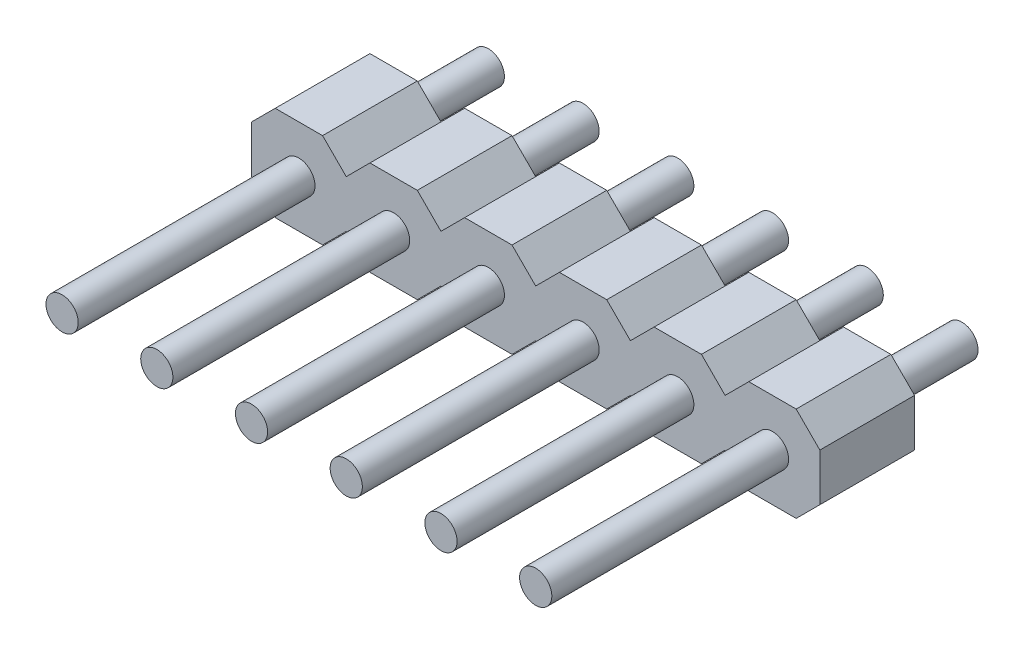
from build123d import *

# Parameters (mm, degrees)
BOSS_EXTRUDE1_DEPTH        = 2.54
BOSS_EXTRUDE4_DEPTH        = 2.54
BOSS_EXTRUDE4_DEPTH_BACK   = 8.89
SKETCH6_R                  = 0.4318
BOSS_EXTRUDE4_2_DEPTH      = 2.54
BOSS_EXTRUDE4_2_DEPTH_BACK = 8.89
BOSS_EXTRUDE4_3_DEPTH      = 2.54
BOSS_EXTRUDE4_3_DEPTH_BACK = 8.89
BOSS_EXTRUDE4_4_DEPTH      = 2.54
BOSS_EXTRUDE4_4_DEPTH_BACK = 8.89
BOSS_EXTRUDE4_5_DEPTH      = 2.54
BOSS_EXTRUDE4_5_DEPTH_BACK = 8.89
BOSS_EXTRUDE4_6_DEPTH      = 2.54
BOSS_EXTRUDE4_6_DEPTH_BACK = 8.89


with BuildPart() as part:
    # Sketch1 → Boss-Extrude1 (new body)
    with BuildSketch(Plane.XY):
        Polygon((13.97, -0.635), (13.335, -1.27), (12.065, -1.27), (11.43, -0.635), (10.795, -1.27), (9.525, -1.27), (8.89, -0.635), (8.255, -1.27), (6.985, -1.27), (6.35, -0.635), (5.715, -1.27), (4.445, -1.27), (3.81, -0.635), (3.175, -1.27), (1.905, -1.27), (1.27, -0.635), (0.635, -1.27), (-0.635, -1.27), (-1.27, -0.635), (-1.27, 0.635), (-0.635, 1.27), (0.635, 1.27), (1.27, 0.635), (1.905, 1.27), (3.175, 1.27), (3.81, 0.635), (4.445, 1.27), (5.715, 1.27), (6.35, 0.635), (6.985, 1.27), (8.255, 1.27), (8.89, 0.635), (9.525, 1.27), (10.795, 1.27), (11.43, 0.635), (12.065, 1.27), (13.335, 1.27), (13.97, 0.635), align=None)
    extrude(amount=BOSS_EXTRUDE1_DEPTH)


with BuildPart() as body_2:
    # Sketch6 → Boss-Extrude4 (new, two sides: drawn at the far end of the back side and taken through both)
    with BuildSketch(Plane(origin=(0, 0, 0), x_dir=(-1, 0, 0), z_dir=(0, 0, -1)).offset(-BOSS_EXTRUDE4_DEPTH_BACK)):
        Circle(SKETCH6_R)
    extrude(amount=BOSS_EXTRUDE4_DEPTH + BOSS_EXTRUDE4_DEPTH_BACK)


with BuildPart() as body_3:
    # Sketch6 → Boss-Extrude4 2 (new, two sides: drawn at the far end of the back side and taken through both)
    with BuildSketch(Plane(origin=(0, 0, 0), x_dir=(-1, 0, 0), z_dir=(0, 0, -1)).offset(-BOSS_EXTRUDE4_2_DEPTH_BACK)):
        with Locations((-2.54, 0)):
            Circle(SKETCH6_R)
    extrude(amount=BOSS_EXTRUDE4_2_DEPTH + BOSS_EXTRUDE4_2_DEPTH_BACK)


with BuildPart() as body_4:
    # Sketch6 → Boss-Extrude4 3 (new, two sides: drawn at the far end of the back side and taken through both)
    with BuildSketch(Plane(origin=(0, 0, 0), x_dir=(-1, 0, 0), z_dir=(0, 0, -1)).offset(-BOSS_EXTRUDE4_3_DEPTH_BACK)):
        with Locations((-5.08, 0)):
            Circle(SKETCH6_R)
    extrude(amount=BOSS_EXTRUDE4_3_DEPTH + BOSS_EXTRUDE4_3_DEPTH_BACK)


with BuildPart() as body_5:
    # Sketch6 → Boss-Extrude4 4 (new, two sides: drawn at the far end of the back side and taken through both)
    with BuildSketch(Plane(origin=(0, 0, 0), x_dir=(-1, 0, 0), z_dir=(0, 0, -1)).offset(-BOSS_EXTRUDE4_4_DEPTH_BACK)):
        with Locations((-7.62, 0)):
            Circle(SKETCH6_R)
    extrude(amount=BOSS_EXTRUDE4_4_DEPTH + BOSS_EXTRUDE4_4_DEPTH_BACK)


with BuildPart() as body_6:
    # Sketch6 → Boss-Extrude4 5 (new, two sides: drawn at the far end of the back side and taken through both)
    with BuildSketch(Plane(origin=(0, 0, 0), x_dir=(-1, 0, 0), z_dir=(0, 0, -1)).offset(-BOSS_EXTRUDE4_5_DEPTH_BACK)):
        with Locations((-10.16, 0)):
            Circle(SKETCH6_R)
    extrude(amount=BOSS_EXTRUDE4_5_DEPTH + BOSS_EXTRUDE4_5_DEPTH_BACK)


with BuildPart() as body_7:
    # Sketch6 → Boss-Extrude4 6 (new, two sides: drawn at the far end of the back side and taken through both)
    with BuildSketch(Plane(origin=(0, 0, 0), x_dir=(-1, 0, 0), z_dir=(0, 0, -1)).offset(-BOSS_EXTRUDE4_6_DEPTH_BACK)):
        with Locations((-12.7, 0)):
            Circle(SKETCH6_R)
    extrude(amount=BOSS_EXTRUDE4_6_DEPTH + BOSS_EXTRUDE4_6_DEPTH_BACK)


solid = Compound([part.part, body_2.part, body_3.part, body_4.part, body_5.part, body_6.part, body_7.part])
